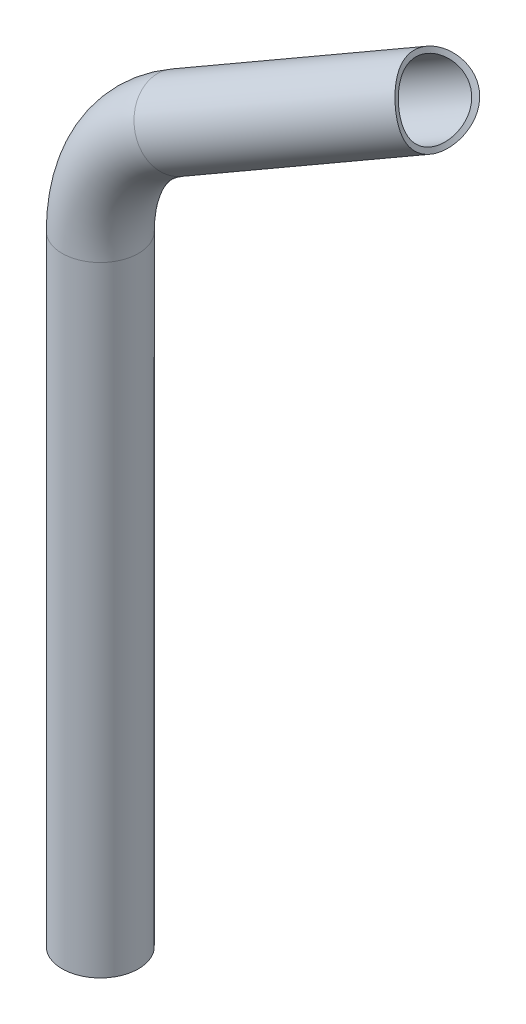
from build123d import *

# Parameters (mm, degrees)
ESQUISSE3_R             = 15
ESQUISSE3_R_2           = 13
ESQUISSE4_R             = 30
ENL_V_MAT_EXTRU_1_DEPTH = 160


with BuildPart() as part:
    # Balayage6: sweep along a path in Esquisse1
    with BuildLine(Plane.XY) as balayage6_path:
        Line((0, 0), (-125, -72.168783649))
        ThreePointArc((-125, -72.168783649), (-146.961524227, -94.130307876), (-155, -124.130307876))
        Line((-155, -124.130307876), (-155, -367.489291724))
    # Esquisse3 → Balayage6 (sweep)
    with BuildSketch(Plane(origin=(-155, -367.489291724, 0), x_dir=(1, 0, 0), z_dir=(0, -1, 0))):
        Circle(ESQUISSE3_R)
        Circle(ESQUISSE3_R_2, mode=Mode.SUBTRACT)
    sweep(path=balayage6_path.line)

    # Esquisse4 → Enl_v. mat.-Extru.1 (cut)
    with BuildSketch(Plane(origin=(53.934489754, -118.865879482, 41.604969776), x_dir=(0.9184436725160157, 0.3574497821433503, -0.16938380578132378), z_dir=(0.3936824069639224, -0.8676341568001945, 0.3036859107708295))):
        Circle(ESQUISSE4_R)
    extrude(amount=-ENL_V_MAT_EXTRU_1_DEPTH, mode=Mode.SUBTRACT)


solid = part.part
